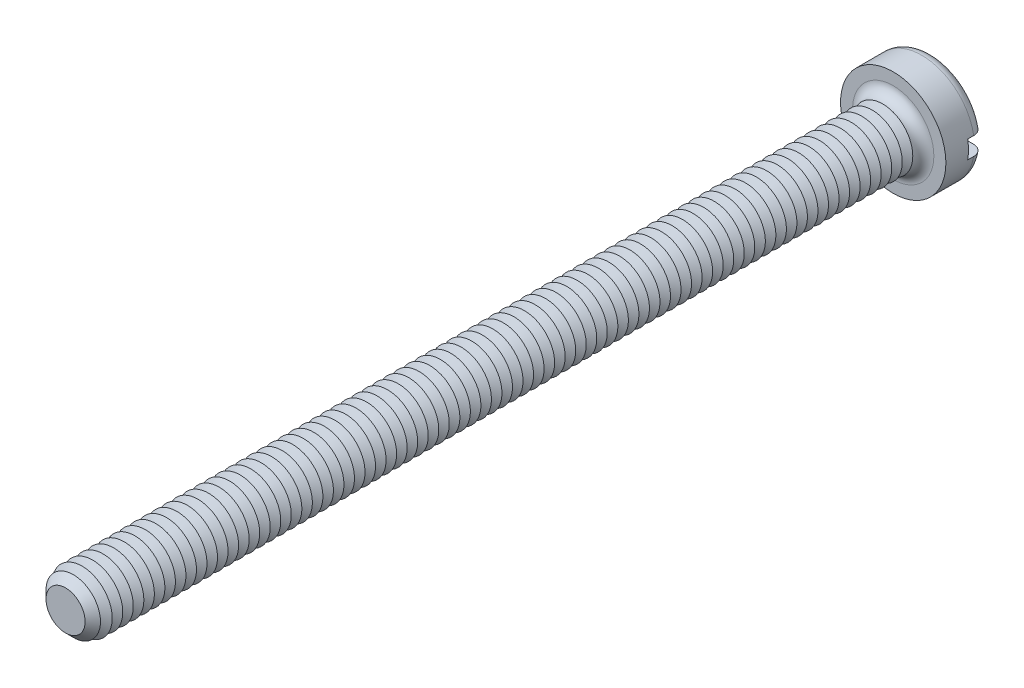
from build123d import *

# Parameters (mm, degrees)
SKETCH3_R           = 3.5
BOSS_EXTRUDE2_DEPTH = 2.6
SKETCH4_R           = 2
BOSS_EXTRUDE3_DEPTH = 55
FILLET1_R           = 0.7
CHAMFER1_SIZE       = 0.7
LPATTERN1_COUNT     = 77
LPATTERN1_PITCH     = 0.7
SKETCH8_W           = 7
SKETCH8_H           = 1.2
CUT_EXTRUDE1_DEPTH  = 1.1


with BuildPart() as part:
    # Sketch3 → Boss-Extrude2 (new body)
    with BuildSketch(Plane.XY):
        Circle(SKETCH3_R)
    extrude(amount=-BOSS_EXTRUDE2_DEPTH)

    # Sketch4 → Boss-Extrude3 (add)
    with BuildSketch(Plane.XY):
        Circle(SKETCH4_R)
    extrude(amount=BOSS_EXTRUDE3_DEPTH)

    # Fillet1
    fillet1_edges = [part.edges().sort_by_distance(p)[0] for p in [
        (-3.5, 0, -2.6),
        (-2, 0, 0),
    ]]
    fillet(fillet1_edges, radius=FILLET1_R)

    # Chamfer1
    chamfer1_edges = [part.edges().sort_by_distance(p)[0] for p in [
        (-2, 0, 55),
    ]]
    chamfer(chamfer1_edges, length=CHAMFER1_SIZE)

    # Sketch6 → Cut-Revolve1 (revolve, cut)
    with BuildSketch(Plane(origin=(0, 0, 0), x_dir=(0, 0, -1), z_dir=(1, 0, 0)), mode=Mode.PRIVATE) as cut_revolve1_sk:
        Polygon((-0.7, 2), (-1.05, 1.393782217), (-1.4, 2), align=None)
    cut_revolve1 = revolve(cut_revolve1_sk.sketch.rotate(Axis((0, 0, -1.694361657), (0, 0, 1)), 90), axis=Axis((0, 0, -1.694361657), (0, 0, 1)), mode=Mode.SUBTRACT)

    # LPattern1: Cut-Revolve1 ×77
    with Locations(*[(0, 0, i * LPATTERN1_PITCH) for i in range(1, LPATTERN1_COUNT)]):
        add(cut_revolve1, mode=Mode.SUBTRACT)

    # Sketch8 → Cut-Extrude1 (cut)
    with BuildSketch(Plane(origin=(0, 0, -2.6), x_dir=(-1, 0, 0), z_dir=(0, 0, -1))):
        Rectangle(SKETCH8_W, SKETCH8_H)
    extrude(amount=-CUT_EXTRUDE1_DEPTH, mode=Mode.SUBTRACT)


solid = part.part
